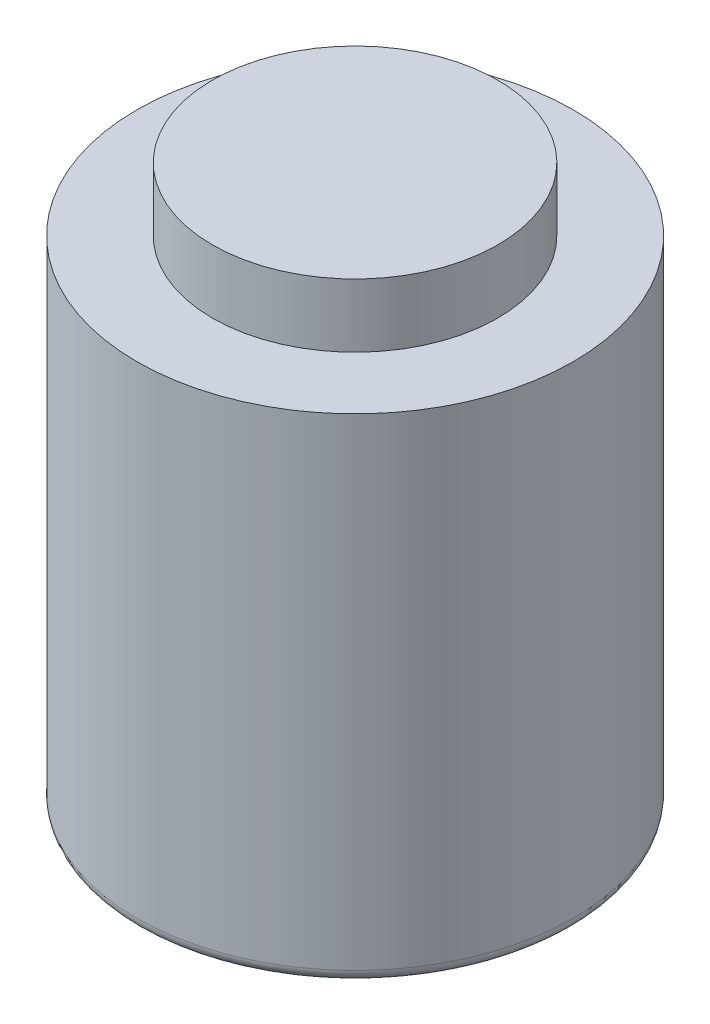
ISO-10303-21;
HEADER;
FILE_DESCRIPTION(('STEP AP214'),'2;1');
FILE_NAME('part.step','',(''),(''),'','','');
FILE_SCHEMA(('AUTOMOTIVE_DESIGN { 1 0 10303 214 1 1 1 1 }'));
ENDSEC;
DATA;
#1=APPLICATION_CONTEXT('core data for automotive mechanical design processes');
#2=APPLICATION_PROTOCOL_DEFINITION('international standard','automotive_design',2000,#1);
#3=PRODUCT_CONTEXT('',#1,'mechanical');
#4=PRODUCT('Part','Part','',(#3));
#5=PRODUCT_RELATED_PRODUCT_CATEGORY('part','',(#4));
#6=PRODUCT_DEFINITION_FORMATION('','',#4);
#7=PRODUCT_DEFINITION_CONTEXT('part definition',#1,'design');
#8=PRODUCT_DEFINITION('design','',#6,#7);
#9=PRODUCT_DEFINITION_SHAPE('','',#8);
#10=(LENGTH_UNIT() NAMED_UNIT(*) SI_UNIT(.MILLI.,.METRE.));
#11=(NAMED_UNIT(*) PLANE_ANGLE_UNIT() SI_UNIT($,.RADIAN.));
#12=(NAMED_UNIT(*) SI_UNIT($,.STERADIAN.) SOLID_ANGLE_UNIT());
#13=UNCERTAINTY_MEASURE_WITH_UNIT(LENGTH_MEASURE(1.E-05),#10,'distance_accuracy_value','');
#14=(GEOMETRIC_REPRESENTATION_CONTEXT(3) GLOBAL_UNCERTAINTY_ASSIGNED_CONTEXT((#13)) GLOBAL_UNIT_ASSIGNED_CONTEXT((#10,
#11,#12)) REPRESENTATION_CONTEXT('',''));
#15=CARTESIAN_POINT('',(0.,0.,0.));
#16=DIRECTION('',(0.,0.,1.));
#17=DIRECTION('',(1.,0.,0.));
#18=AXIS2_PLACEMENT_3D('',#15,#16,#17);
#19=CARTESIAN_POINT('',(0.,39.,0.));
#20=DIRECTION('',(0.,-1.,0.));
#21=DIRECTION('',(0.,0.,-1.));
#22=AXIS2_PLACEMENT_3D('',#19,#20,#21);
#23=CYLINDRICAL_SURFACE('',#22,17.2);
#24=CARTESIAN_POINT('',(0.,1.,0.));
#25=DIRECTION('',(0.,1.,0.));
#26=DIRECTION('',(0.,0.,1.));
#27=AXIS2_PLACEMENT_3D('',#24,#25,#26);
#28=CIRCLE('',#27,17.2);
#29=CARTESIAN_POINT('',(0.,1.,17.2));
#30=VERTEX_POINT('',#29);
#31=EDGE_CURVE('E50',#30,#30,#28,.T.);
#32=ORIENTED_EDGE('',*,*,#31,.T.);
#33=EDGE_LOOP('',(#32));
#34=FACE_BOUND('',#33,.T.);
#35=CARTESIAN_POINT('',(0.,39.,0.));
#36=DIRECTION('',(0.,1.,0.));
#37=DIRECTION('',(0.,0.,1.));
#38=AXIS2_PLACEMENT_3D('',#35,#36,#37);
#39=CIRCLE('',#38,17.2);
#40=CARTESIAN_POINT('',(0.,39.,17.2));
#41=VERTEX_POINT('',#40);
#42=EDGE_CURVE('E130',#41,#41,#39,.T.);
#43=ORIENTED_EDGE('',*,*,#42,.F.);
#44=EDGE_LOOP('',(#43));
#45=FACE_BOUND('',#44,.T.);
#46=ADVANCED_FACE('F42',(#34,#45),#23,.T.);
#47=CARTESIAN_POINT('',(0.,39.,0.));
#48=DIRECTION('',(0.,1.,0.));
#49=DIRECTION('',(0.,0.,1.));
#50=AXIS2_PLACEMENT_3D('',#47,#48,#49);
#51=PLANE('',#50);
#52=CARTESIAN_POINT('',(0.,39.,0.));
#53=DIRECTION('',(0.,1.,0.));
#54=DIRECTION('',(0.,0.,1.));
#55=AXIS2_PLACEMENT_3D('',#52,#53,#54);
#56=CIRCLE('',#55,11.25);
#57=CARTESIAN_POINT('',(0.,39.,11.25));
#58=VERTEX_POINT('',#57);
#59=EDGE_CURVE('E127',#58,#58,#56,.T.);
#60=ORIENTED_EDGE('',*,*,#59,.F.);
#61=EDGE_LOOP('',(#60));
#62=FACE_BOUND('',#61,.T.);
#63=ORIENTED_EDGE('',*,*,#42,.T.);
#64=EDGE_LOOP('',(#63));
#65=FACE_BOUND('',#64,.T.);
#66=ADVANCED_FACE('F147',(#62,#65),#51,.T.);
#67=CARTESIAN_POINT('',(0.,0.,0.));
#68=DIRECTION('',(0.,1.,0.));
#69=DIRECTION('',(0.,0.,1.));
#70=AXIS2_PLACEMENT_3D('',#67,#68,#69);
#71=PLANE('',#70);
#72=CARTESIAN_POINT('',(0.,0.,0.));
#73=DIRECTION('',(0.,1.,0.));
#74=DIRECTION('',(0.,0.,1.));
#75=AXIS2_PLACEMENT_3D('',#72,#73,#74);
#76=CIRCLE('',#75,16.2);
#77=CARTESIAN_POINT('',(0.,0.,16.2));
#78=VERTEX_POINT('',#77);
#79=EDGE_CURVE('E11',#78,#78,#76,.F.);
#80=ORIENTED_EDGE('',*,*,#79,.T.);
#81=EDGE_LOOP('',(#80));
#82=FACE_BOUND('',#81,.T.);
#83=CARTESIAN_POINT('',(11.6913429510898,0.,6.75000000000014));
#84=DIRECTION('',(0.,-1.,0.));
#85=DIRECTION('',(0.,0.,-1.));
#86=AXIS2_PLACEMENT_3D('',#83,#84,#85);
#87=CIRCLE('',#86,1.025);
#88=CARTESIAN_POINT('',(11.6913429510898,0.,5.72500000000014));
#89=VERTEX_POINT('',#88);
#90=EDGE_CURVE('E80',#89,#89,#87,.T.);
#91=ORIENTED_EDGE('',*,*,#90,.F.);
#92=EDGE_LOOP('',(#91));
#93=FACE_BOUND('',#92,.T.);
#94=CARTESIAN_POINT('',(11.69134295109,0.,-6.74999999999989));
#95=DIRECTION('',(0.,-1.,0.));
#96=DIRECTION('',(0.,0.,-1.));
#97=AXIS2_PLACEMENT_3D('',#94,#95,#96);
#98=CIRCLE('',#97,1.025);
#99=CARTESIAN_POINT('',(11.69134295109,0.,-7.77499999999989));
#100=VERTEX_POINT('',#99);
#101=EDGE_CURVE('E79',#100,#100,#98,.T.);
#102=ORIENTED_EDGE('',*,*,#101,.F.);
#103=EDGE_LOOP('',(#102));
#104=FACE_BOUND('',#103,.T.);
#105=CARTESIAN_POINT('',(0.,0.,-13.5));
#106=DIRECTION('',(0.,-1.,0.));
#107=DIRECTION('',(0.,0.,-1.));
#108=AXIS2_PLACEMENT_3D('',#105,#106,#107);
#109=CIRCLE('',#108,1.025);
#110=CARTESIAN_POINT('',(0.,0.,-14.525));
#111=VERTEX_POINT('',#110);
#112=EDGE_CURVE('E90',#111,#111,#109,.T.);
#113=ORIENTED_EDGE('',*,*,#112,.F.);
#114=EDGE_LOOP('',(#113));
#115=FACE_BOUND('',#114,.T.);
#116=CARTESIAN_POINT('',(-11.6913429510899,0.,-6.75000000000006));
#117=DIRECTION('',(0.,-1.,0.));
#118=DIRECTION('',(0.,0.,-1.));
#119=AXIS2_PLACEMENT_3D('',#116,#117,#118);
#120=CIRCLE('',#119,1.025);
#121=CARTESIAN_POINT('',(-11.6913429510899,0.,-7.77500000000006));
#122=VERTEX_POINT('',#121);
#123=EDGE_CURVE('E96',#122,#122,#120,.T.);
#124=ORIENTED_EDGE('',*,*,#123,.F.);
#125=EDGE_LOOP('',(#124));
#126=FACE_BOUND('',#125,.T.);
#127=CARTESIAN_POINT('',(-11.6913429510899,0.,6.74999999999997));
#128=DIRECTION('',(0.,-1.,0.));
#129=DIRECTION('',(0.,0.,-1.));
#130=AXIS2_PLACEMENT_3D('',#127,#128,#129);
#131=CIRCLE('',#130,1.025);
#132=CARTESIAN_POINT('',(-11.6913429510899,0.,5.72499999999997));
#133=VERTEX_POINT('',#132);
#134=EDGE_CURVE('E102',#133,#133,#131,.T.);
#135=ORIENTED_EDGE('',*,*,#134,.F.);
#136=EDGE_LOOP('',(#135));
#137=FACE_BOUND('',#136,.T.);
#138=CARTESIAN_POINT('',(0.,0.,13.5));
#139=DIRECTION('',(0.,-1.,0.));
#140=DIRECTION('',(0.,0.,-1.));
#141=AXIS2_PLACEMENT_3D('',#138,#139,#140);
#142=CIRCLE('',#141,1.025);
#143=CARTESIAN_POINT('',(0.,0.,12.475));
#144=VERTEX_POINT('',#143);
#145=EDGE_CURVE('E108',#144,#144,#142,.T.);
#146=ORIENTED_EDGE('',*,*,#145,.F.);
#147=EDGE_LOOP('',(#146));
#148=FACE_BOUND('',#147,.T.);
#149=CARTESIAN_POINT('',(0.,0.,0.));
#150=DIRECTION('',(0.,-1.,0.));
#151=DIRECTION('',(0.,0.,-1.));
#152=AXIS2_PLACEMENT_3D('',#149,#150,#151);
#153=CIRCLE('',#152,4.);
#154=CARTESIAN_POINT('',(0.,0.,-4.));
#155=VERTEX_POINT('',#154);
#156=EDGE_CURVE('E121',#155,#155,#153,.T.);
#157=ORIENTED_EDGE('',*,*,#156,.F.);
#158=EDGE_LOOP('',(#157));
#159=FACE_BOUND('',#158,.T.);
#160=ADVANCED_FACE('F151',(#82,#93,#104,#115,#126,#137,#148,#159),#71,.F.);
#161=CARTESIAN_POINT('',(0.,44.,0.));
#162=DIRECTION('',(0.,-1.,0.));
#163=DIRECTION('',(0.,0.,-1.));
#164=AXIS2_PLACEMENT_3D('',#161,#162,#163);
#165=CYLINDRICAL_SURFACE('',#164,11.25);
#166=CARTESIAN_POINT('',(0.,44.,0.));
#167=DIRECTION('',(0.,1.,0.));
#168=DIRECTION('',(0.,0.,1.));
#169=AXIS2_PLACEMENT_3D('',#166,#167,#168);
#170=CIRCLE('',#169,11.25);
#171=CARTESIAN_POINT('',(0.,44.,11.25));
#172=VERTEX_POINT('',#171);
#173=EDGE_CURVE('E124',#172,#172,#170,.T.);
#174=ORIENTED_EDGE('',*,*,#173,.F.);
#175=EDGE_LOOP('',(#174));
#176=FACE_BOUND('',#175,.T.);
#177=ORIENTED_EDGE('',*,*,#59,.T.);
#178=EDGE_LOOP('',(#177));
#179=FACE_BOUND('',#178,.T.);
#180=ADVANCED_FACE('F156',(#176,#179),#165,.T.);
#181=CARTESIAN_POINT('',(0.,44.,0.));
#182=DIRECTION('',(0.,1.,0.));
#183=DIRECTION('',(0.,0.,1.));
#184=AXIS2_PLACEMENT_3D('',#181,#182,#183);
#185=PLANE('',#184);
#186=ORIENTED_EDGE('',*,*,#173,.T.);
#187=EDGE_LOOP('',(#186));
#188=FACE_BOUND('',#187,.T.);
#189=ADVANCED_FACE('F161',(#188),#185,.T.);
#190=CARTESIAN_POINT('',(0.,-3.,0.));
#191=DIRECTION('',(0.,1.,0.));
#192=DIRECTION('',(0.,0.,1.));
#193=AXIS2_PLACEMENT_3D('',#190,#191,#192);
#194=CYLINDRICAL_SURFACE('',#193,4.);
#195=CARTESIAN_POINT('',(0.,-3.,0.));
#196=DIRECTION('',(0.,-1.,0.));
#197=DIRECTION('',(0.,0.,-1.));
#198=AXIS2_PLACEMENT_3D('',#195,#196,#197);
#199=CIRCLE('',#198,4.);
#200=CARTESIAN_POINT('',(0.,-3.,-4.));
#201=VERTEX_POINT('',#200);
#202=EDGE_CURVE('E117',#201,#201,#199,.T.);
#203=ORIENTED_EDGE('',*,*,#202,.F.);
#204=EDGE_LOOP('',(#203));
#205=FACE_BOUND('',#204,.T.);
#206=ORIENTED_EDGE('',*,*,#156,.T.);
#207=EDGE_LOOP('',(#206));
#208=FACE_BOUND('',#207,.T.);
#209=ADVANCED_FACE('F165',(#205,#208),#194,.T.);
#210=CARTESIAN_POINT('',(0.,-3.,0.));
#211=DIRECTION('',(0.,-1.,0.));
#212=DIRECTION('',(0.,0.,-1.));
#213=AXIS2_PLACEMENT_3D('',#210,#211,#212);
#214=PLANE('',#213);
#215=CARTESIAN_POINT('',(0.,-3.,0.));
#216=DIRECTION('',(0.,-1.,0.));
#217=DIRECTION('',(0.,0.,-1.));
#218=AXIS2_PLACEMENT_3D('',#215,#216,#217);
#219=CIRCLE('',#218,1.);
#220=CARTESIAN_POINT('',(0.,-3.,-1.));
#221=VERTEX_POINT('',#220);
#222=EDGE_CURVE('E118',#221,#221,#219,.T.);
#223=ORIENTED_EDGE('',*,*,#222,.F.);
#224=EDGE_LOOP('',(#223));
#225=FACE_BOUND('',#224,.T.);
#226=ORIENTED_EDGE('',*,*,#202,.T.);
#227=EDGE_LOOP('',(#226));
#228=FACE_BOUND('',#227,.T.);
#229=ADVANCED_FACE('F169',(#225,#228),#214,.T.);
#230=CARTESIAN_POINT('',(0.,-10.,0.));
#231=DIRECTION('',(0.,1.,0.));
#232=DIRECTION('',(0.,0.,1.));
#233=AXIS2_PLACEMENT_3D('',#230,#231,#232);
#234=CYLINDRICAL_SURFACE('',#233,1.);
#235=CARTESIAN_POINT('',(0.,-10.,0.));
#236=DIRECTION('',(0.,-1.,0.));
#237=DIRECTION('',(0.,0.,-1.));
#238=AXIS2_PLACEMENT_3D('',#235,#236,#237);
#239=CIRCLE('',#238,1.);
#240=CARTESIAN_POINT('',(0.,-10.,-1.));
#241=VERTEX_POINT('',#240);
#242=EDGE_CURVE('E114',#241,#241,#239,.T.);
#243=ORIENTED_EDGE('',*,*,#242,.F.);
#244=EDGE_LOOP('',(#243));
#245=FACE_BOUND('',#244,.T.);
#246=ORIENTED_EDGE('',*,*,#222,.T.);
#247=EDGE_LOOP('',(#246));
#248=FACE_BOUND('',#247,.T.);
#249=ADVANCED_FACE('F173',(#245,#248),#234,.T.);
#250=CARTESIAN_POINT('',(0.,-10.,0.));
#251=DIRECTION('',(0.,-1.,0.));
#252=DIRECTION('',(0.,0.,-1.));
#253=AXIS2_PLACEMENT_3D('',#250,#251,#252);
#254=PLANE('',#253);
#255=ORIENTED_EDGE('',*,*,#242,.T.);
#256=EDGE_LOOP('',(#255));
#257=FACE_BOUND('',#256,.T.);
#258=ADVANCED_FACE('F177',(#257),#254,.T.);
#259=CARTESIAN_POINT('',(0.,5.38411786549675,13.5));
#260=DIRECTION('',(0.,-1.,0.));
#261=DIRECTION('',(0.,0.,-1.));
#262=AXIS2_PLACEMENT_3D('',#259,#260,#261);
#263=CONICAL_SURFACE('',#262,1.025,1.02974425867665);
#264=CARTESIAN_POINT('',(0.,6.,13.5));
#265=VERTEX_POINT('',#264);
#266=VERTEX_LOOP('',#265);
#267=FACE_BOUND('',#266,.T.);
#268=CARTESIAN_POINT('',(0.,5.38411786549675,13.5));
#269=DIRECTION('',(0.,-1.,0.));
#270=DIRECTION('',(0.,0.,-1.));
#271=AXIS2_PLACEMENT_3D('',#268,#269,#270);
#272=CIRCLE('',#271,1.025);
#273=CARTESIAN_POINT('',(0.,5.38411786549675,12.475));
#274=VERTEX_POINT('',#273);
#275=EDGE_CURVE('E111',#274,#274,#272,.T.);
#276=ORIENTED_EDGE('',*,*,#275,.T.);
#277=EDGE_LOOP('',(#276));
#278=FACE_BOUND('',#277,.T.);
#279=ADVANCED_FACE('F181',(#267,#278),#263,.F.);
#280=CARTESIAN_POINT('',(0.,0.,13.5));
#281=DIRECTION('',(0.,-1.,0.));
#282=DIRECTION('',(0.,0.,-1.));
#283=AXIS2_PLACEMENT_3D('',#280,#281,#282);
#284=CYLINDRICAL_SURFACE('',#283,1.025);
#285=ORIENTED_EDGE('',*,*,#275,.F.);
#286=EDGE_LOOP('',(#285));
#287=FACE_BOUND('',#286,.T.);
#288=ORIENTED_EDGE('',*,*,#145,.T.);
#289=EDGE_LOOP('',(#288));
#290=FACE_BOUND('',#289,.T.);
#291=ADVANCED_FACE('F185',(#287,#290),#284,.F.);
#292=CARTESIAN_POINT('',(-11.6913429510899,5.38411786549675,6.74999999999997));
#293=DIRECTION('',(0.,-1.,0.));
#294=DIRECTION('',(0.,0.,-1.));
#295=AXIS2_PLACEMENT_3D('',#292,#293,#294);
#296=CONICAL_SURFACE('',#295,1.025,1.02974425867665);
#297=CARTESIAN_POINT('',(-11.6913429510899,6.,6.74999999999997));
#298=VERTEX_POINT('',#297);
#299=VERTEX_LOOP('',#298);
#300=FACE_BOUND('',#299,.T.);
#301=CARTESIAN_POINT('',(-11.6913429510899,5.38411786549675,6.74999999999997));
#302=DIRECTION('',(0.,-1.,0.));
#303=DIRECTION('',(0.,0.,-1.));
#304=AXIS2_PLACEMENT_3D('',#301,#302,#303);
#305=CIRCLE('',#304,1.025);
#306=CARTESIAN_POINT('',(-11.6913429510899,5.38411786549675,5.72499999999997));
#307=VERTEX_POINT('',#306);
#308=EDGE_CURVE('E105',#307,#307,#305,.T.);
#309=ORIENTED_EDGE('',*,*,#308,.T.);
#310=EDGE_LOOP('',(#309));
#311=FACE_BOUND('',#310,.T.);
#312=ADVANCED_FACE('F188',(#300,#311),#296,.F.);
#313=CARTESIAN_POINT('',(-11.6913429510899,0.,6.74999999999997));
#314=DIRECTION('',(0.,-1.,0.));
#315=DIRECTION('',(0.,0.,-1.));
#316=AXIS2_PLACEMENT_3D('',#313,#314,#315);
#317=CYLINDRICAL_SURFACE('',#316,1.025);
#318=ORIENTED_EDGE('',*,*,#308,.F.);
#319=EDGE_LOOP('',(#318));
#320=FACE_BOUND('',#319,.T.);
#321=ORIENTED_EDGE('',*,*,#134,.T.);
#322=EDGE_LOOP('',(#321));
#323=FACE_BOUND('',#322,.T.);
#324=ADVANCED_FACE('F192',(#320,#323),#317,.F.);
#325=CARTESIAN_POINT('',(-11.6913429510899,5.38411786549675,-6.75000000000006));
#326=DIRECTION('',(0.,-1.,0.));
#327=DIRECTION('',(0.,0.,-1.));
#328=AXIS2_PLACEMENT_3D('',#325,#326,#327);
#329=CONICAL_SURFACE('',#328,1.025,1.02974425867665);
#330=CARTESIAN_POINT('',(-11.6913429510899,6.,-6.75000000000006));
#331=VERTEX_POINT('',#330);
#332=VERTEX_LOOP('',#331);
#333=FACE_BOUND('',#332,.T.);
#334=CARTESIAN_POINT('',(-11.6913429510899,5.38411786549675,-6.75000000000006));
#335=DIRECTION('',(0.,-1.,0.));
#336=DIRECTION('',(0.,0.,-1.));
#337=AXIS2_PLACEMENT_3D('',#334,#335,#336);
#338=CIRCLE('',#337,1.025);
#339=CARTESIAN_POINT('',(-11.6913429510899,5.38411786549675,-7.77500000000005));
#340=VERTEX_POINT('',#339);
#341=EDGE_CURVE('E99',#340,#340,#338,.T.);
#342=ORIENTED_EDGE('',*,*,#341,.T.);
#343=EDGE_LOOP('',(#342));
#344=FACE_BOUND('',#343,.T.);
#345=ADVANCED_FACE('F195',(#333,#344),#329,.F.);
#346=CARTESIAN_POINT('',(-11.6913429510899,0.,-6.75000000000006));
#347=DIRECTION('',(0.,-1.,0.));
#348=DIRECTION('',(0.,0.,-1.));
#349=AXIS2_PLACEMENT_3D('',#346,#347,#348);
#350=CYLINDRICAL_SURFACE('',#349,1.025);
#351=ORIENTED_EDGE('',*,*,#341,.F.);
#352=EDGE_LOOP('',(#351));
#353=FACE_BOUND('',#352,.T.);
#354=ORIENTED_EDGE('',*,*,#123,.T.);
#355=EDGE_LOOP('',(#354));
#356=FACE_BOUND('',#355,.T.);
#357=ADVANCED_FACE('F199',(#353,#356),#350,.F.);
#358=CARTESIAN_POINT('',(0.,5.38411786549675,-13.5));
#359=DIRECTION('',(0.,-1.,0.));
#360=DIRECTION('',(0.,0.,-1.));
#361=AXIS2_PLACEMENT_3D('',#358,#359,#360);
#362=CONICAL_SURFACE('',#361,1.025,1.02974425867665);
#363=CARTESIAN_POINT('',(0.,6.,-13.5));
#364=VERTEX_POINT('',#363);
#365=VERTEX_LOOP('',#364);
#366=FACE_BOUND('',#365,.T.);
#367=CARTESIAN_POINT('',(0.,5.38411786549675,-13.5));
#368=DIRECTION('',(0.,-1.,0.));
#369=DIRECTION('',(0.,0.,-1.));
#370=AXIS2_PLACEMENT_3D('',#367,#368,#369);
#371=CIRCLE('',#370,1.025);
#372=CARTESIAN_POINT('',(0.,5.38411786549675,-14.525));
#373=VERTEX_POINT('',#372);
#374=EDGE_CURVE('E93',#373,#373,#371,.T.);
#375=ORIENTED_EDGE('',*,*,#374,.T.);
#376=EDGE_LOOP('',(#375));
#377=FACE_BOUND('',#376,.T.);
#378=ADVANCED_FACE('F203',(#366,#377),#362,.F.);
#379=CARTESIAN_POINT('',(0.,0.,-13.5));
#380=DIRECTION('',(0.,-1.,0.));
#381=DIRECTION('',(0.,0.,-1.));
#382=AXIS2_PLACEMENT_3D('',#379,#380,#381);
#383=CYLINDRICAL_SURFACE('',#382,1.025);
#384=ORIENTED_EDGE('',*,*,#374,.F.);
#385=EDGE_LOOP('',(#384));
#386=FACE_BOUND('',#385,.T.);
#387=ORIENTED_EDGE('',*,*,#112,.T.);
#388=EDGE_LOOP('',(#387));
#389=FACE_BOUND('',#388,.T.);
#390=ADVANCED_FACE('F207',(#386,#389),#383,.F.);
#391=CARTESIAN_POINT('',(11.69134295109,5.38411786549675,-6.74999999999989));
#392=DIRECTION('',(0.,-1.,0.));
#393=DIRECTION('',(0.,0.,-1.));
#394=AXIS2_PLACEMENT_3D('',#391,#392,#393);
#395=CONICAL_SURFACE('',#394,1.025,1.02974425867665);
#396=CARTESIAN_POINT('',(11.69134295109,6.,-6.74999999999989));
#397=VERTEX_POINT('',#396);
#398=VERTEX_LOOP('',#397);
#399=FACE_BOUND('',#398,.T.);
#400=CARTESIAN_POINT('',(11.69134295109,5.38411786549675,-6.74999999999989));
#401=DIRECTION('',(0.,-1.,0.));
#402=DIRECTION('',(0.,0.,-1.));
#403=AXIS2_PLACEMENT_3D('',#400,#401,#402);
#404=CIRCLE('',#403,1.025);
#405=CARTESIAN_POINT('',(11.69134295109,5.38411786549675,-7.77499999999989));
#406=VERTEX_POINT('',#405);
#407=EDGE_CURVE('E83',#406,#406,#404,.T.);
#408=ORIENTED_EDGE('',*,*,#407,.T.);
#409=EDGE_LOOP('',(#408));
#410=FACE_BOUND('',#409,.T.);
#411=ADVANCED_FACE('F211',(#399,#410),#395,.F.);
#412=CARTESIAN_POINT('',(11.69134295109,0.,-6.74999999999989));
#413=DIRECTION('',(0.,-1.,0.));
#414=DIRECTION('',(0.,0.,-1.));
#415=AXIS2_PLACEMENT_3D('',#412,#413,#414);
#416=CYLINDRICAL_SURFACE('',#415,1.025);
#417=ORIENTED_EDGE('',*,*,#407,.F.);
#418=EDGE_LOOP('',(#417));
#419=FACE_BOUND('',#418,.T.);
#420=ORIENTED_EDGE('',*,*,#101,.T.);
#421=EDGE_LOOP('',(#420));
#422=FACE_BOUND('',#421,.T.);
#423=ADVANCED_FACE('F73',(#419,#422),#416,.F.);
#424=CARTESIAN_POINT('',(11.6913429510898,5.38411786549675,6.75000000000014));
#425=DIRECTION('',(0.,-1.,0.));
#426=DIRECTION('',(0.,0.,-1.));
#427=AXIS2_PLACEMENT_3D('',#424,#425,#426);
#428=CONICAL_SURFACE('',#427,1.025,1.02974425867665);
#429=CARTESIAN_POINT('',(11.6913429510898,6.,6.75000000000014));
#430=VERTEX_POINT('',#429);
#431=VERTEX_LOOP('',#430);
#432=FACE_BOUND('',#431,.T.);
#433=CARTESIAN_POINT('',(11.6913429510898,5.38411786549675,6.75000000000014));
#434=DIRECTION('',(0.,-1.,0.));
#435=DIRECTION('',(0.,0.,-1.));
#436=AXIS2_PLACEMENT_3D('',#433,#434,#435);
#437=CIRCLE('',#436,1.025);
#438=CARTESIAN_POINT('',(11.6913429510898,5.38411786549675,5.72500000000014));
#439=VERTEX_POINT('',#438);
#440=EDGE_CURVE('E77',#439,#439,#437,.T.);
#441=ORIENTED_EDGE('',*,*,#440,.T.);
#442=EDGE_LOOP('',(#441));
#443=FACE_BOUND('',#442,.T.);
#444=ADVANCED_FACE('F69',(#432,#443),#428,.F.);
#445=CARTESIAN_POINT('',(11.6913429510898,0.,6.75000000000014));
#446=DIRECTION('',(0.,-1.,0.));
#447=DIRECTION('',(0.,0.,-1.));
#448=AXIS2_PLACEMENT_3D('',#445,#446,#447);
#449=CYLINDRICAL_SURFACE('',#448,1.025);
#450=ORIENTED_EDGE('',*,*,#440,.F.);
#451=EDGE_LOOP('',(#450));
#452=FACE_BOUND('',#451,.T.);
#453=ORIENTED_EDGE('',*,*,#90,.T.);
#454=EDGE_LOOP('',(#453));
#455=FACE_BOUND('',#454,.T.);
#456=ADVANCED_FACE('F72',(#452,#455),#449,.F.);
#457=CARTESIAN_POINT('',(0.,1.,0.));
#458=DIRECTION('',(0.,1.,0.));
#459=DIRECTION('',(0.,0.,1.));
#460=AXIS2_PLACEMENT_3D('',#457,#458,#459);
#461=TOROIDAL_SURFACE('',#460,16.2,1.);
#462=ORIENTED_EDGE('',*,*,#79,.F.);
#463=EDGE_LOOP('',(#462));
#464=FACE_BOUND('',#463,.T.);
#465=ORIENTED_EDGE('',*,*,#31,.F.);
#466=EDGE_LOOP('',(#465));
#467=FACE_BOUND('',#466,.T.);
#468=ADVANCED_FACE('F44',(#464,#467),#461,.T.);
#469=CLOSED_SHELL('',(#46,#66,#160,#180,#189,#209,#229,#249,#258,#279,#291,#312,#324,#345,#357,
#378,#390,#411,#423,#444,#456,#468));
#470=MANIFOLD_SOLID_BREP('B2',#469);
#471=ADVANCED_BREP_SHAPE_REPRESENTATION('',(#18,#470),#14);
#472=SHAPE_DEFINITION_REPRESENTATION(#9,#471);
ENDSEC;
END-ISO-10303-21;
